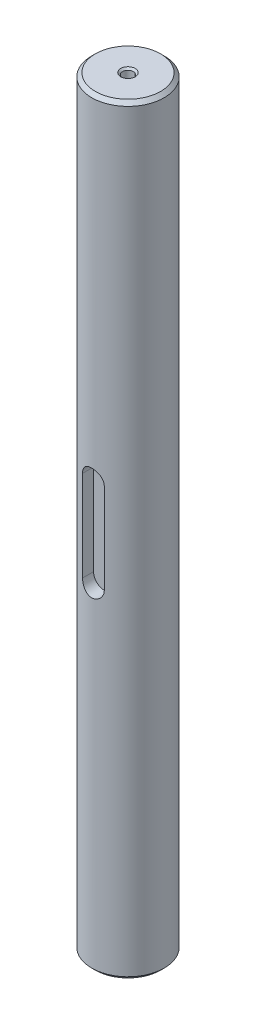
from build123d import *

# Parameters (mm, degrees)
SKETCH1_R           = 10
BOSS_EXTRUDE1_DEPTH = 105
CUT_EXTRUDE1_DEPTH  = 3.5
CHAMFER1_SIZE       = 1
SKETCH4_R           = 1.5
CUT_EXTRUDE2_DEPTH  = 211.475651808
CHAMFER2_SIZE       = 0.5


with BuildPart() as part:
    # Sketch1 → Boss-Extrude1 (new, symmetric)
    with BuildSketch(Plane(origin=(0, 0, 0), x_dir=(1, 0, 0), z_dir=(0, 1, 0))):
        with Locations(Location((0, 0, 0), (0, 0, 270))):
            Circle(SKETCH1_R)
    extrude(amount=BOSS_EXTRUDE1_DEPTH, both=True)

    # Sketch3 → Cut-Extrude1 (cut)
    with BuildSketch(Plane(origin=(0, -105, 10), x_dir=(0, -1, 0), z_dir=(0, 0, -1))):
        with BuildLine():
            Line((-92.5, 3), (-117.5, 3))
            ThreePointArc((-117.5, 3), (-120.5, 0), (-117.5, -3))
            Line((-117.5, -3), (-92.5, -3))
            ThreePointArc((-92.5, -3), (-89.5, 0), (-92.5, 3))
        make_face()
    extrude(amount=CUT_EXTRUDE1_DEPTH, mode=Mode.SUBTRACT)

    # Chamfer1
    chamfer1_edges = [part.edges().sort_by_distance(p)[0] for p in [
        (0, -105, -10),
        (0, 105, -10),
    ]]
    chamfer(chamfer1_edges, length=CHAMFER1_SIZE)

    # Sketch4 → Cut-Extrude2 (cut, through all)
    with BuildSketch(Plane.XZ.offset(105)):
        with Locations(Location((0, 0, 0), (0, 0, 270))):
            Circle(SKETCH4_R)
    extrude(amount=-CUT_EXTRUDE2_DEPTH, mode=Mode.SUBTRACT)

    # Chamfer2
    chamfer2_edges = [part.edges().sort_by_distance(p)[0] for p in [
        (0, 105, 1.5),
        (0, -105, 1.5),
    ]]
    chamfer(chamfer2_edges, length=CHAMFER2_SIZE)


solid = part.part
